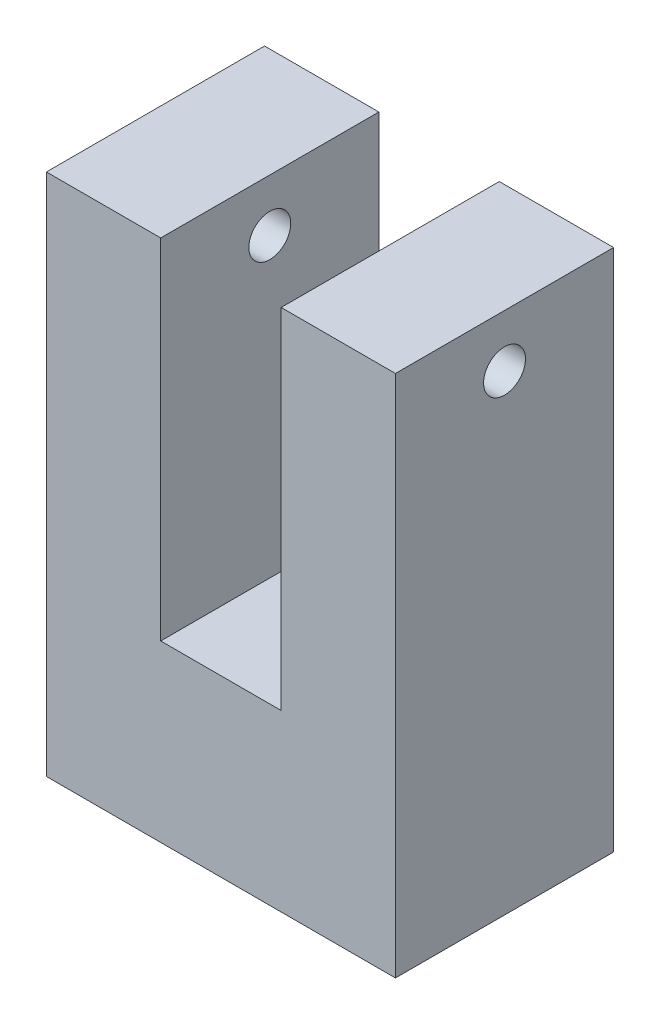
from build123d import *

# Parameters (mm, degrees)
SKETCH1_W           = 25.4
SKETCH1_H           = 15.875
BOSS_EXTRUDE1_DEPTH = 38.1
SKETCH2_W           = 8.763
SKETCH2_H           = 25.4
CUT_EXTRUDE1_DEPTH  = 44.184668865
SKETCH3_R           = 1.524
CUT_EXTRUDE2_DEPTH  = 47.473367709
SKETCH4_R           = 2.0955
CUT_EXTRUDE3_DEPTH  = 41.937805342


with BuildPart() as part:
    # Sketch1 → Boss-Extrude1 (new body)
    with BuildSketch(Plane(origin=(0, 0, 0), x_dir=(1, 0, 0), z_dir=(0, 1, 0))):
        Rectangle(SKETCH1_W, SKETCH1_H)
    extrude(amount=BOSS_EXTRUDE1_DEPTH)

    # Sketch2 → Cut-Extrude1 (cut, through all)
    with BuildSketch(Plane.XY.offset(7.9375)):
        with Locations((0, 25.4)):
            Rectangle(SKETCH2_W, SKETCH2_H)
    extrude(amount=-CUT_EXTRUDE1_DEPTH, mode=Mode.SUBTRACT)

    # Sketch3 → Cut-Extrude2 (cut, through all)
    with BuildSketch(Plane(origin=(12.7, 0, 0), x_dir=(0, 0, -1), z_dir=(1, 0, 0))):
        with Locations((0, 34.29)):
            Circle(SKETCH3_R)
    extrude(amount=-CUT_EXTRUDE2_DEPTH, mode=Mode.SUBTRACT)

    # Sketch4 → Cut-Extrude3 (cut, through all)
    with BuildSketch(Plane.XZ):
        with Locations(Location((0, 0, 0), (0, 0, 270))):
            Circle(SKETCH4_R)
    extrude(amount=-CUT_EXTRUDE3_DEPTH, mode=Mode.SUBTRACT)


solid = part.part
